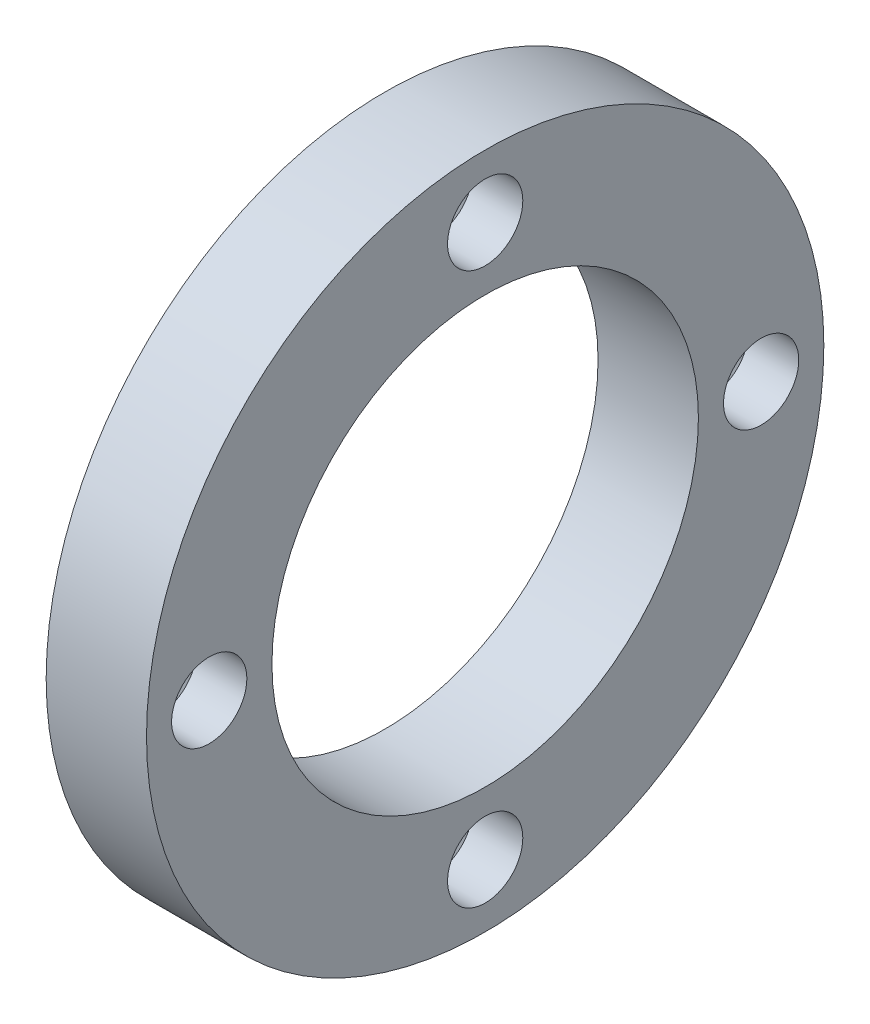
ISO-10303-21;
HEADER;
FILE_DESCRIPTION(('STEP AP214'),'2;1');
FILE_NAME('part.step','',(''),(''),'','','');
FILE_SCHEMA(('AUTOMOTIVE_DESIGN { 1 0 10303 214 1 1 1 1 }'));
ENDSEC;
DATA;
#1=APPLICATION_CONTEXT('core data for automotive mechanical design processes');
#2=APPLICATION_PROTOCOL_DEFINITION('international standard','automotive_design',2000,#1);
#3=PRODUCT_CONTEXT('',#1,'mechanical');
#4=PRODUCT('Part','Part','',(#3));
#5=PRODUCT_RELATED_PRODUCT_CATEGORY('part','',(#4));
#6=PRODUCT_DEFINITION_FORMATION('','',#4);
#7=PRODUCT_DEFINITION_CONTEXT('part definition',#1,'design');
#8=PRODUCT_DEFINITION('design','',#6,#7);
#9=PRODUCT_DEFINITION_SHAPE('','',#8);
#10=(LENGTH_UNIT() NAMED_UNIT(*) SI_UNIT(.MILLI.,.METRE.));
#11=(NAMED_UNIT(*) PLANE_ANGLE_UNIT() SI_UNIT($,.RADIAN.));
#12=(NAMED_UNIT(*) SI_UNIT($,.STERADIAN.) SOLID_ANGLE_UNIT());
#13=UNCERTAINTY_MEASURE_WITH_UNIT(LENGTH_MEASURE(1.E-05),#10,'distance_accuracy_value','');
#14=(GEOMETRIC_REPRESENTATION_CONTEXT(3) GLOBAL_UNCERTAINTY_ASSIGNED_CONTEXT((#13)) GLOBAL_UNIT_ASSIGNED_CONTEXT((#10,
#11,#12)) REPRESENTATION_CONTEXT('',''));
#15=CARTESIAN_POINT('',(0.,0.,0.));
#16=DIRECTION('',(0.,0.,1.));
#17=DIRECTION('',(1.,0.,0.));
#18=AXIS2_PLACEMENT_3D('',#15,#16,#17);
#19=CARTESIAN_POINT('',(0.,13.5000000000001,0.));
#20=DIRECTION('',(1.,0.,0.));
#21=DIRECTION('',(0.,0.,-1.));
#22=AXIS2_PLACEMENT_3D('',#19,#20,#21);
#23=PLANE('',#22);
#24=CARTESIAN_POINT('',(0.,0.,0.));
#25=DIRECTION('',(-1.,0.,0.));
#26=DIRECTION('',(0.,0.,1.));
#27=AXIS2_PLACEMENT_3D('',#24,#25,#26);
#28=CIRCLE('',#27,8.5);
#29=CARTESIAN_POINT('',(0.,0.,8.50000000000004));
#30=VERTEX_POINT('',#29);
#31=EDGE_CURVE('E11',#30,#30,#28,.T.);
#32=ORIENTED_EDGE('',*,*,#31,.F.);
#33=EDGE_LOOP('',(#32));
#34=FACE_BOUND('',#33,.T.);
#35=CARTESIAN_POINT('',(0.,0.,0.));
#36=DIRECTION('',(-1.,0.,0.));
#37=DIRECTION('',(0.,0.,1.));
#38=AXIS2_PLACEMENT_3D('',#35,#36,#37);
#39=CIRCLE('',#38,13.5);
#40=CARTESIAN_POINT('',(0.,0.,13.5000000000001));
#41=VERTEX_POINT('',#40);
#42=EDGE_CURVE('E87',#41,#41,#39,.T.);
#43=ORIENTED_EDGE('',*,*,#42,.T.);
#44=EDGE_LOOP('',(#43));
#45=FACE_BOUND('',#44,.T.);
#46=ADVANCED_FACE('F34',(#34,#45),#23,.F.);
#47=CARTESIAN_POINT('',(0.,0.,0.));
#48=DIRECTION('',(-1.,0.,0.));
#49=DIRECTION('',(0.,0.,1.));
#50=AXIS2_PLACEMENT_3D('',#47,#48,#49);
#51=CYLINDRICAL_SURFACE('',#50,8.5);
#52=CARTESIAN_POINT('',(4.,0.,0.));
#53=DIRECTION('',(-1.,0.,0.));
#54=DIRECTION('',(0.,0.,1.));
#55=AXIS2_PLACEMENT_3D('',#52,#53,#54);
#56=CIRCLE('',#55,8.5);
#57=CARTESIAN_POINT('',(4.,0.,8.50000000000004));
#58=VERTEX_POINT('',#57);
#59=EDGE_CURVE('E41',#58,#58,#56,.T.);
#60=ORIENTED_EDGE('',*,*,#59,.F.);
#61=EDGE_LOOP('',(#60));
#62=FACE_BOUND('',#61,.T.);
#63=ORIENTED_EDGE('',*,*,#31,.T.);
#64=EDGE_LOOP('',(#63));
#65=FACE_BOUND('',#64,.T.);
#66=ADVANCED_FACE('F97',(#62,#65),#51,.F.);
#67=CARTESIAN_POINT('',(4.,13.5000000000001,0.));
#68=DIRECTION('',(-1.,0.,0.));
#69=DIRECTION('',(0.,0.,1.));
#70=AXIS2_PLACEMENT_3D('',#67,#68,#69);
#71=PLANE('',#70);
#72=CARTESIAN_POINT('',(4.,1.1521895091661E-13,11.));
#73=DIRECTION('',(1.,0.,0.));
#74=DIRECTION('',(0.,0.,-1.));
#75=AXIS2_PLACEMENT_3D('',#72,#73,#74);
#76=CIRCLE('',#75,1.5);
#77=CARTESIAN_POINT('',(4.,1.1521895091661E-13,9.50000000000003));
#78=VERTEX_POINT('',#77);
#79=EDGE_CURVE('E65',#78,#78,#76,.T.);
#80=ORIENTED_EDGE('',*,*,#79,.F.);
#81=EDGE_LOOP('',(#80));
#82=FACE_BOUND('',#81,.T.);
#83=CARTESIAN_POINT('',(4.,-11.,0.));
#84=DIRECTION('',(1.,0.,0.));
#85=DIRECTION('',(0.,0.,-1.));
#86=AXIS2_PLACEMENT_3D('',#83,#84,#85);
#87=CIRCLE('',#86,1.5);
#88=CARTESIAN_POINT('',(4.,-11.,-1.49999999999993));
#89=VERTEX_POINT('',#88);
#90=EDGE_CURVE('E64',#89,#89,#87,.T.);
#91=ORIENTED_EDGE('',*,*,#90,.F.);
#92=EDGE_LOOP('',(#91));
#93=FACE_BOUND('',#92,.T.);
#94=CARTESIAN_POINT('',(4.,0.,-11.));
#95=DIRECTION('',(1.,0.,0.));
#96=DIRECTION('',(0.,0.,-1.));
#97=AXIS2_PLACEMENT_3D('',#94,#95,#96);
#98=CIRCLE('',#97,1.5);
#99=CARTESIAN_POINT('',(4.,0.,-12.5));
#100=VERTEX_POINT('',#99);
#101=EDGE_CURVE('E75',#100,#100,#98,.T.);
#102=ORIENTED_EDGE('',*,*,#101,.F.);
#103=EDGE_LOOP('',(#102));
#104=FACE_BOUND('',#103,.T.);
#105=CARTESIAN_POINT('',(4.,11.,0.));
#106=DIRECTION('',(1.,0.,0.));
#107=DIRECTION('',(0.,0.,-1.));
#108=AXIS2_PLACEMENT_3D('',#105,#106,#107);
#109=CIRCLE('',#108,1.5);
#110=CARTESIAN_POINT('',(4.,11.,-1.50000000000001));
#111=VERTEX_POINT('',#110);
#112=EDGE_CURVE('E81',#111,#111,#109,.T.);
#113=ORIENTED_EDGE('',*,*,#112,.F.);
#114=EDGE_LOOP('',(#113));
#115=FACE_BOUND('',#114,.T.);
#116=CARTESIAN_POINT('',(4.,0.,0.));
#117=DIRECTION('',(-1.,0.,0.));
#118=DIRECTION('',(0.,0.,1.));
#119=AXIS2_PLACEMENT_3D('',#116,#117,#118);
#120=CIRCLE('',#119,13.5);
#121=CARTESIAN_POINT('',(4.,0.,13.5000000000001));
#122=VERTEX_POINT('',#121);
#123=EDGE_CURVE('E90',#122,#122,#120,.T.);
#124=ORIENTED_EDGE('',*,*,#123,.F.);
#125=EDGE_LOOP('',(#124));
#126=FACE_BOUND('',#125,.T.);
#127=ORIENTED_EDGE('',*,*,#59,.T.);
#128=EDGE_LOOP('',(#127));
#129=FACE_BOUND('',#128,.T.);
#130=ADVANCED_FACE('F95',(#82,#93,#104,#115,#126,#129),#71,.F.);
#131=CARTESIAN_POINT('',(0.,0.,0.));
#132=DIRECTION('',(-1.,0.,0.));
#133=DIRECTION('',(0.,0.,1.));
#134=AXIS2_PLACEMENT_3D('',#131,#132,#133);
#135=CYLINDRICAL_SURFACE('',#134,13.5);
#136=ORIENTED_EDGE('',*,*,#42,.F.);
#137=EDGE_LOOP('',(#136));
#138=FACE_BOUND('',#137,.T.);
#139=ORIENTED_EDGE('',*,*,#123,.T.);
#140=EDGE_LOOP('',(#139));
#141=FACE_BOUND('',#140,.T.);
#142=ADVANCED_FACE('F106',(#138,#141),#135,.T.);
#143=CARTESIAN_POINT('',(1.99999999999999,11.,0.));
#144=DIRECTION('',(1.,0.,0.));
#145=DIRECTION('',(0.,0.,-1.));
#146=AXIS2_PLACEMENT_3D('',#143,#144,#145);
#147=CONICAL_SURFACE('',#146,1.5,1.02974425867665);
#148=CARTESIAN_POINT('',(1.09870907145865,11.,0.));
#149=VERTEX_POINT('',#148);
#150=VERTEX_LOOP('',#149);
#151=FACE_BOUND('',#150,.T.);
#152=CARTESIAN_POINT('',(1.99999999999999,11.,0.));
#153=DIRECTION('',(1.,0.,0.));
#154=DIRECTION('',(0.,0.,-1.));
#155=AXIS2_PLACEMENT_3D('',#152,#153,#154);
#156=CIRCLE('',#155,1.5);
#157=CARTESIAN_POINT('',(1.99999999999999,11.,-1.50000000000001));
#158=VERTEX_POINT('',#157);
#159=EDGE_CURVE('E84',#158,#158,#156,.T.);
#160=ORIENTED_EDGE('',*,*,#159,.T.);
#161=EDGE_LOOP('',(#160));
#162=FACE_BOUND('',#161,.T.);
#163=ADVANCED_FACE('F109',(#151,#162),#147,.F.);
#164=CARTESIAN_POINT('',(4.,11.,0.));
#165=DIRECTION('',(1.,0.,0.));
#166=DIRECTION('',(0.,0.,-1.));
#167=AXIS2_PLACEMENT_3D('',#164,#165,#166);
#168=CYLINDRICAL_SURFACE('',#167,1.5);
#169=ORIENTED_EDGE('',*,*,#159,.F.);
#170=EDGE_LOOP('',(#169));
#171=FACE_BOUND('',#170,.T.);
#172=ORIENTED_EDGE('',*,*,#112,.T.);
#173=EDGE_LOOP('',(#172));
#174=FACE_BOUND('',#173,.T.);
#175=ADVANCED_FACE('F123',(#171,#174),#168,.F.);
#176=CARTESIAN_POINT('',(1.99999999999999,0.,-11.));
#177=DIRECTION('',(1.,0.,0.));
#178=DIRECTION('',(0.,0.,-1.));
#179=AXIS2_PLACEMENT_3D('',#176,#177,#178);
#180=CONICAL_SURFACE('',#179,1.5,1.02974425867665);
#181=CARTESIAN_POINT('',(1.09870907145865,0.,-11.));
#182=VERTEX_POINT('',#181);
#183=VERTEX_LOOP('',#182);
#184=FACE_BOUND('',#183,.T.);
#185=CARTESIAN_POINT('',(1.99999999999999,0.,-11.));
#186=DIRECTION('',(1.,0.,0.));
#187=DIRECTION('',(0.,0.,-1.));
#188=AXIS2_PLACEMENT_3D('',#185,#186,#187);
#189=CIRCLE('',#188,1.5);
#190=CARTESIAN_POINT('',(1.99999999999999,0.,-12.5));
#191=VERTEX_POINT('',#190);
#192=EDGE_CURVE('E78',#191,#191,#189,.T.);
#193=ORIENTED_EDGE('',*,*,#192,.T.);
#194=EDGE_LOOP('',(#193));
#195=FACE_BOUND('',#194,.T.);
#196=ADVANCED_FACE('F126',(#184,#195),#180,.F.);
#197=CARTESIAN_POINT('',(4.,0.,-11.));
#198=DIRECTION('',(1.,0.,0.));
#199=DIRECTION('',(0.,0.,-1.));
#200=AXIS2_PLACEMENT_3D('',#197,#198,#199);
#201=CYLINDRICAL_SURFACE('',#200,1.5);
#202=ORIENTED_EDGE('',*,*,#192,.F.);
#203=EDGE_LOOP('',(#202));
#204=FACE_BOUND('',#203,.T.);
#205=ORIENTED_EDGE('',*,*,#101,.T.);
#206=EDGE_LOOP('',(#205));
#207=FACE_BOUND('',#206,.T.);
#208=ADVANCED_FACE('F130',(#204,#207),#201,.F.);
#209=CARTESIAN_POINT('',(1.99999999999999,-11.,0.));
#210=DIRECTION('',(1.,0.,0.));
#211=DIRECTION('',(0.,0.,-1.));
#212=AXIS2_PLACEMENT_3D('',#209,#210,#211);
#213=CONICAL_SURFACE('',#212,1.5,1.02974425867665);
#214=CARTESIAN_POINT('',(1.09870907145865,-11.,0.));
#215=VERTEX_POINT('',#214);
#216=VERTEX_LOOP('',#215);
#217=FACE_BOUND('',#216,.T.);
#218=CARTESIAN_POINT('',(1.99999999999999,-11.,0.));
#219=DIRECTION('',(1.,0.,0.));
#220=DIRECTION('',(0.,0.,-1.));
#221=AXIS2_PLACEMENT_3D('',#218,#219,#220);
#222=CIRCLE('',#221,1.5);
#223=CARTESIAN_POINT('',(1.99999999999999,-11.,-1.49999999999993));
#224=VERTEX_POINT('',#223);
#225=EDGE_CURVE('E68',#224,#224,#222,.T.);
#226=ORIENTED_EDGE('',*,*,#225,.T.);
#227=EDGE_LOOP('',(#226));
#228=FACE_BOUND('',#227,.T.);
#229=ADVANCED_FACE('F133',(#217,#228),#213,.F.);
#230=CARTESIAN_POINT('',(4.,-11.,0.));
#231=DIRECTION('',(1.,0.,0.));
#232=DIRECTION('',(0.,0.,-1.));
#233=AXIS2_PLACEMENT_3D('',#230,#231,#232);
#234=CYLINDRICAL_SURFACE('',#233,1.5);
#235=ORIENTED_EDGE('',*,*,#225,.F.);
#236=EDGE_LOOP('',(#235));
#237=FACE_BOUND('',#236,.T.);
#238=ORIENTED_EDGE('',*,*,#90,.T.);
#239=EDGE_LOOP('',(#238));
#240=FACE_BOUND('',#239,.T.);
#241=ADVANCED_FACE('F58',(#237,#240),#234,.F.);
#242=CARTESIAN_POINT('',(1.99999999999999,1.1521895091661E-13,11.));
#243=DIRECTION('',(1.,0.,0.));
#244=DIRECTION('',(0.,0.,-1.));
#245=AXIS2_PLACEMENT_3D('',#242,#243,#244);
#246=CONICAL_SURFACE('',#245,1.5,1.02974425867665);
#247=CARTESIAN_POINT('',(1.09870907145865,1.14508339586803E-13,11.));
#248=VERTEX_POINT('',#247);
#249=VERTEX_LOOP('',#248);
#250=FACE_BOUND('',#249,.T.);
#251=CARTESIAN_POINT('',(1.99999999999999,1.1521895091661E-13,11.));
#252=DIRECTION('',(1.,0.,0.));
#253=DIRECTION('',(0.,0.,-1.));
#254=AXIS2_PLACEMENT_3D('',#251,#252,#253);
#255=CIRCLE('',#254,1.5);
#256=CARTESIAN_POINT('',(1.99999999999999,1.1521895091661E-13,9.50000000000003));
#257=VERTEX_POINT('',#256);
#258=EDGE_CURVE('E62',#257,#257,#255,.T.);
#259=ORIENTED_EDGE('',*,*,#258,.T.);
#260=EDGE_LOOP('',(#259));
#261=FACE_BOUND('',#260,.T.);
#262=ADVANCED_FACE('F54',(#250,#261),#246,.F.);
#263=CARTESIAN_POINT('',(4.,1.1521895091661E-13,11.));
#264=DIRECTION('',(1.,0.,0.));
#265=DIRECTION('',(0.,0.,-1.));
#266=AXIS2_PLACEMENT_3D('',#263,#264,#265);
#267=CYLINDRICAL_SURFACE('',#266,1.5);
#268=ORIENTED_EDGE('',*,*,#258,.F.);
#269=EDGE_LOOP('',(#268));
#270=FACE_BOUND('',#269,.T.);
#271=ORIENTED_EDGE('',*,*,#79,.T.);
#272=EDGE_LOOP('',(#271));
#273=FACE_BOUND('',#272,.T.);
#274=ADVANCED_FACE('F57',(#270,#273),#267,.F.);
#275=CLOSED_SHELL('',(#46,#66,#130,#142,#163,#175,#196,#208,#229,#241,#262,#274));
#276=MANIFOLD_SOLID_BREP('B2',#275);
#277=ADVANCED_BREP_SHAPE_REPRESENTATION('',(#18,#276),#14);
#278=SHAPE_DEFINITION_REPRESENTATION(#9,#277);
ENDSEC;
END-ISO-10303-21;
